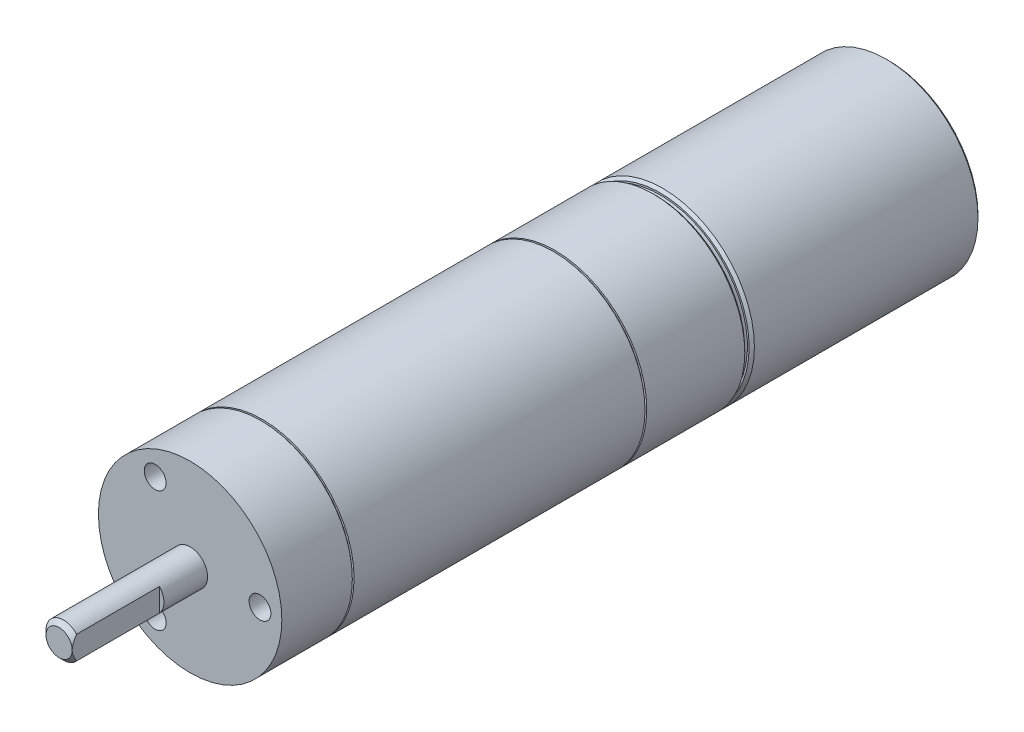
ISO-10303-21;
HEADER;
FILE_DESCRIPTION(('STEP AP214'),'2;1');
FILE_NAME('part.step','',(''),(''),'','','');
FILE_SCHEMA(('AUTOMOTIVE_DESIGN { 1 0 10303 214 1 1 1 1 }'));
ENDSEC;
DATA;
#1=APPLICATION_CONTEXT('core data for automotive mechanical design processes');
#2=APPLICATION_PROTOCOL_DEFINITION('international standard','automotive_design',2000,#1);
#3=PRODUCT_CONTEXT('',#1,'mechanical');
#4=PRODUCT('Part','Part','',(#3));
#5=PRODUCT_RELATED_PRODUCT_CATEGORY('part','',(#4));
#6=PRODUCT_DEFINITION_FORMATION('','',#4);
#7=PRODUCT_DEFINITION_CONTEXT('part definition',#1,'design');
#8=PRODUCT_DEFINITION('design','',#6,#7);
#9=PRODUCT_DEFINITION_SHAPE('','',#8);
#10=(LENGTH_UNIT() NAMED_UNIT(*) SI_UNIT(.MILLI.,.METRE.));
#11=(NAMED_UNIT(*) PLANE_ANGLE_UNIT() SI_UNIT($,.RADIAN.));
#12=(NAMED_UNIT(*) SI_UNIT($,.STERADIAN.) SOLID_ANGLE_UNIT());
#13=UNCERTAINTY_MEASURE_WITH_UNIT(LENGTH_MEASURE(1.E-05),#10,'distance_accuracy_value','');
#14=(GEOMETRIC_REPRESENTATION_CONTEXT(3) GLOBAL_UNCERTAINTY_ASSIGNED_CONTEXT((#13)) GLOBAL_UNIT_ASSIGNED_CONTEXT((#10,
#11,#12)) REPRESENTATION_CONTEXT('',''));
#15=CARTESIAN_POINT('',(0.,0.,0.));
#16=DIRECTION('',(0.,0.,1.));
#17=DIRECTION('',(1.,0.,0.));
#18=AXIS2_PLACEMENT_3D('',#15,#16,#17);
#19=CARTESIAN_POINT('',(0.,0.,80.));
#20=DIRECTION('',(0.,0.,-1.));
#21=DIRECTION('',(-1.,0.,0.));
#22=AXIS2_PLACEMENT_3D('',#19,#20,#21);
#23=CYLINDRICAL_SURFACE('',#22,10.5);
#24=CARTESIAN_POINT('',(0.,0.,26.9977784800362));
#25=DIRECTION('',(0.,0.,-1.));
#26=DIRECTION('',(-1.,0.,0.));
#27=AXIS2_PLACEMENT_3D('',#24,#25,#26);
#28=CIRCLE('',#27,10.5);
#29=CARTESIAN_POINT('',(-10.5,0.,26.9977784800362));
#30=VERTEX_POINT('',#29);
#31=EDGE_CURVE('E155',#30,#30,#28,.F.);
#32=ORIENTED_EDGE('',*,*,#31,.T.);
#33=EDGE_LOOP('',(#32));
#34=FACE_BOUND('',#33,.T.);
#35=CARTESIAN_POINT('',(0.,0.,38.2215074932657));
#36=DIRECTION('',(0.,0.,1.));
#37=DIRECTION('',(1.,0.,0.));
#38=AXIS2_PLACEMENT_3D('',#35,#36,#37);
#39=CIRCLE('',#38,10.5);
#40=CARTESIAN_POINT('',(10.5,0.,38.2215074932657));
#41=VERTEX_POINT('',#40);
#42=EDGE_CURVE('E99',#41,#41,#39,.T.);
#43=ORIENTED_EDGE('',*,*,#42,.F.);
#44=EDGE_LOOP('',(#43));
#45=FACE_BOUND('',#44,.T.);
#46=ADVANCED_FACE('F38',(#34,#45),#23,.T.);
#47=CARTESIAN_POINT('',(0.,0.,71.7283946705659));
#48=DIRECTION('',(0.,0.,1.));
#49=DIRECTION('',(1.,0.,0.));
#50=AXIS2_PLACEMENT_3D('',#47,#48,#49);
#51=CIRCLE('',#50,10.5);
#52=CARTESIAN_POINT('',(10.5,0.,71.7283946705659));
#53=VERTEX_POINT('',#52);
#54=EDGE_CURVE('E102',#53,#53,#51,.T.);
#55=ORIENTED_EDGE('',*,*,#54,.F.);
#56=EDGE_LOOP('',(#55));
#57=FACE_BOUND('',#56,.T.);
#58=CARTESIAN_POINT('',(0.,0.,38.4215074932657));
#59=DIRECTION('',(0.,0.,-1.));
#60=DIRECTION('',(-1.,0.,0.));
#61=AXIS2_PLACEMENT_3D('',#58,#59,#60);
#62=CIRCLE('',#61,10.5);
#63=CARTESIAN_POINT('',(-10.5,0.,38.4215074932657));
#64=VERTEX_POINT('',#63);
#65=EDGE_CURVE('E94',#64,#64,#62,.T.);
#66=ORIENTED_EDGE('',*,*,#65,.F.);
#67=EDGE_LOOP('',(#66));
#68=FACE_BOUND('',#67,.T.);
#69=ADVANCED_FACE('F190',(#57,#68),#23,.T.);
#70=CARTESIAN_POINT('',(0.,0.,80.));
#71=DIRECTION('',(0.,0.,1.));
#72=DIRECTION('',(1.,0.,0.));
#73=AXIS2_PLACEMENT_3D('',#70,#71,#72);
#74=CIRCLE('',#73,10.5);
#75=CARTESIAN_POINT('',(10.5,0.,80.));
#76=VERTEX_POINT('',#75);
#77=EDGE_CURVE('E125',#76,#76,#74,.T.);
#78=ORIENTED_EDGE('',*,*,#77,.F.);
#79=EDGE_LOOP('',(#78));
#80=FACE_BOUND('',#79,.T.);
#81=CARTESIAN_POINT('',(0.,0.,71.9283946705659));
#82=DIRECTION('',(0.,0.,-1.));
#83=DIRECTION('',(-1.,0.,0.));
#84=AXIS2_PLACEMENT_3D('',#81,#82,#83);
#85=CIRCLE('',#84,10.5);
#86=CARTESIAN_POINT('',(-10.5,0.,71.9283946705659));
#87=VERTEX_POINT('',#86);
#88=EDGE_CURVE('E110',#87,#87,#85,.T.);
#89=ORIENTED_EDGE('',*,*,#88,.F.);
#90=EDGE_LOOP('',(#89));
#91=FACE_BOUND('',#90,.T.);
#92=ADVANCED_FACE('F174',(#80,#91),#23,.T.);
#93=CARTESIAN_POINT('',(0.,0.,80.));
#94=DIRECTION('',(0.,0.,1.));
#95=DIRECTION('',(1.,0.,0.));
#96=AXIS2_PLACEMENT_3D('',#93,#94,#95);
#97=PLANE('',#96);
#98=CARTESIAN_POINT('',(-4.00000000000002,-6.9282032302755,80.));
#99=DIRECTION('',(0.,0.,1.));
#100=DIRECTION('',(1.,0.,0.));
#101=AXIS2_PLACEMENT_3D('',#98,#99,#100);
#102=CIRCLE('',#101,1.25);
#103=CARTESIAN_POINT('',(-2.75000000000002,-6.9282032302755,80.));
#104=VERTEX_POINT('',#103);
#105=EDGE_CURVE('E107',#104,#104,#102,.T.);
#106=ORIENTED_EDGE('',*,*,#105,.F.);
#107=EDGE_LOOP('',(#106));
#108=FACE_BOUND('',#107,.T.);
#109=CARTESIAN_POINT('',(8.,0.,80.));
#110=DIRECTION('',(0.,0.,1.));
#111=DIRECTION('',(1.,0.,0.));
#112=AXIS2_PLACEMENT_3D('',#109,#110,#111);
#113=CIRCLE('',#112,1.25);
#114=CARTESIAN_POINT('',(9.25,0.,80.));
#115=VERTEX_POINT('',#114);
#116=EDGE_CURVE('E106',#115,#115,#113,.T.);
#117=ORIENTED_EDGE('',*,*,#116,.F.);
#118=EDGE_LOOP('',(#117));
#119=FACE_BOUND('',#118,.T.);
#120=CARTESIAN_POINT('',(-3.99999999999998,6.92820323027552,80.));
#121=DIRECTION('',(0.,0.,1.));
#122=DIRECTION('',(1.,0.,0.));
#123=AXIS2_PLACEMENT_3D('',#120,#121,#122);
#124=CIRCLE('',#123,1.25);
#125=CARTESIAN_POINT('',(-2.74999999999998,6.92820323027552,80.));
#126=VERTEX_POINT('',#125);
#127=EDGE_CURVE('E114',#126,#126,#124,.T.);
#128=ORIENTED_EDGE('',*,*,#127,.F.);
#129=EDGE_LOOP('',(#128));
#130=FACE_BOUND('',#129,.T.);
#131=ORIENTED_EDGE('',*,*,#77,.T.);
#132=EDGE_LOOP('',(#131));
#133=FACE_BOUND('',#132,.T.);
#134=CARTESIAN_POINT('',(0.,0.,80.));
#135=DIRECTION('',(0.,0.,1.));
#136=DIRECTION('',(1.,0.,0.));
#137=AXIS2_PLACEMENT_3D('',#134,#135,#136);
#138=CIRCLE('',#137,2.);
#139=CARTESIAN_POINT('',(2.,0.,80.));
#140=VERTEX_POINT('',#139);
#141=EDGE_CURVE('E120',#140,#140,#138,.T.);
#142=ORIENTED_EDGE('',*,*,#141,.F.);
#143=EDGE_LOOP('',(#142));
#144=FACE_BOUND('',#143,.T.);
#145=ADVANCED_FACE('F201',(#108,#119,#130,#133,#144),#97,.T.);
#146=CARTESIAN_POINT('',(0.,0.,95.));
#147=DIRECTION('',(0.,0.,-1.));
#148=DIRECTION('',(-1.,0.,0.));
#149=AXIS2_PLACEMENT_3D('',#146,#147,#148);
#150=CYLINDRICAL_SURFACE('',#149,2.);
#151=CARTESIAN_POINT('',(0.,0.,94.5));
#152=DIRECTION('',(0.,0.,1.));
#153=DIRECTION('',(1.,0.,0.));
#154=AXIS2_PLACEMENT_3D('',#151,#152,#153);
#155=CIRCLE('',#154,2.);
#156=CARTESIAN_POINT('',(1.5,-1.32287565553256,94.5));
#157=VERTEX_POINT('',#156);
#158=CARTESIAN_POINT('',(1.5,1.3228756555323,94.5));
#159=VERTEX_POINT('',#158);
#160=EDGE_CURVE('E78',#157,#159,#155,.F.);
#161=ORIENTED_EDGE('',*,*,#160,.T.);
#162=DIRECTION('',(0.,0.,-1.));
#163=VECTOR('',#162,1.);
#164=CARTESIAN_POINT('',(1.5,1.3228756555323,95.));
#165=LINE('',#164,#163);
#166=CARTESIAN_POINT('',(1.5,1.3228756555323,85.));
#167=VERTEX_POINT('',#166);
#168=EDGE_CURVE('E57',#159,#167,#165,.T.);
#169=ORIENTED_EDGE('',*,*,#168,.T.);
#170=CARTESIAN_POINT('',(0.,0.,85.));
#171=DIRECTION('',(0.,0.,1.));
#172=DIRECTION('',(1.,0.,0.));
#173=AXIS2_PLACEMENT_3D('',#170,#171,#172);
#174=CIRCLE('',#173,2.);
#175=CARTESIAN_POINT('',(1.5,-1.32287565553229,85.));
#176=VERTEX_POINT('',#175);
#177=EDGE_CURVE('E11',#176,#167,#174,.T.);
#178=ORIENTED_EDGE('',*,*,#177,.F.);
#179=DIRECTION('',(0.,0.,-1.));
#180=VECTOR('',#179,1.);
#181=CARTESIAN_POINT('',(1.5,-1.32287565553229,95.));
#182=LINE('',#181,#180);
#183=EDGE_CURVE('E72',#176,#157,#182,.F.);
#184=ORIENTED_EDGE('',*,*,#183,.T.);
#185=EDGE_LOOP('',(#161,#169,#178,#184));
#186=FACE_BOUND('',#185,.T.);
#187=ORIENTED_EDGE('',*,*,#141,.T.);
#188=EDGE_LOOP('',(#187));
#189=FACE_BOUND('',#188,.T.);
#190=ADVANCED_FACE('F75',(#186,#189),#150,.T.);
#191=CARTESIAN_POINT('',(0.,0.,95.));
#192=DIRECTION('',(0.,0.,1.));
#193=DIRECTION('',(1.,0.,0.));
#194=AXIS2_PLACEMENT_3D('',#191,#192,#193);
#195=PLANE('',#194);
#196=CARTESIAN_POINT('',(0.,0.,95.));
#197=DIRECTION('',(0.,0.,1.));
#198=DIRECTION('',(1.,0.,0.));
#199=AXIS2_PLACEMENT_3D('',#196,#197,#198);
#200=CIRCLE('',#199,1.50000000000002);
#201=CARTESIAN_POINT('',(1.50000000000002,0.,95.));
#202=VERTEX_POINT('',#201);
#203=EDGE_CURVE('E128',#202,#202,#200,.T.);
#204=ORIENTED_EDGE('',*,*,#203,.T.);
#205=EDGE_LOOP('',(#204));
#206=FACE_BOUND('',#205,.T.);
#207=ADVANCED_FACE('F172',(#206),#195,.T.);
#208=CARTESIAN_POINT('',(0.,0.,95.));
#209=DIRECTION('',(0.,0.,-1.));
#210=DIRECTION('',(-1.,0.,0.));
#211=AXIS2_PLACEMENT_3D('',#208,#209,#210);
#212=CONICAL_SURFACE('',#211,1.50000000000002,0.785398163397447);
#213=CARTESIAN_POINT('',(1.5,-2.91383447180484,93.2227402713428));
#214=CARTESIAN_POINT('',(1.5,-2.84632281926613,93.282755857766));
#215=CARTESIAN_POINT('',(1.5,-2.77860211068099,93.3425385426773));
#216=CARTESIAN_POINT('',(1.5,-2.64263139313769,93.4615133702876));
#217=CARTESIAN_POINT('',(1.5,-2.57438132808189,93.5207054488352));
#218=CARTESIAN_POINT('',(1.5,-2.43695412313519,93.6386196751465));
#219=CARTESIAN_POINT('',(1.5,-2.36777422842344,93.6973386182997));
#220=CARTESIAN_POINT('',(1.5,-2.22864291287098,93.8138499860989));
#221=CARTESIAN_POINT('',(1.5,-2.15869152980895,93.871642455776));
#222=CARTESIAN_POINT('',(1.5,-2.01369677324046,93.9894064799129));
#223=CARTESIAN_POINT('',(1.5,-1.93859546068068,94.0493069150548));
#224=CARTESIAN_POINT('',(1.5,-1.78703130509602,94.1673579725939));
#225=CARTESIAN_POINT('',(1.5,-1.71056855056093,94.2255087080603));
#226=CARTESIAN_POINT('',(1.5,-1.5560213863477,94.339335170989));
#227=CARTESIAN_POINT('',(1.5,-1.477940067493,94.3950150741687));
#228=CARTESIAN_POINT('',(1.5,-1.31952631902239,94.5030563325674));
#229=CARTESIAN_POINT('',(1.5,-1.23919471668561,94.5554188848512));
#230=CARTESIAN_POINT('',(1.5,-1.10052560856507,94.6401240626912));
#231=CARTESIAN_POINT('',(1.5,-1.04294766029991,94.673703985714));
#232=CARTESIAN_POINT('',(1.5,-0.926084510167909,94.7378300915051));
#233=CARTESIAN_POINT('',(1.5,-0.86679878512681,94.7683753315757));
#234=CARTESIAN_POINT('',(1.5,-0.746799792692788,94.8252042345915));
#235=CARTESIAN_POINT('',(1.5,-0.686102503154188,94.851521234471));
#236=CARTESIAN_POINT('',(1.5,-0.562697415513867,94.8989401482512));
#237=CARTESIAN_POINT('',(1.5,-0.499990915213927,94.9200453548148));
#238=CARTESIAN_POINT('',(1.5,-0.392743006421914,94.9500019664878));
#239=CARTESIAN_POINT('',(1.5,-0.348695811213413,94.960619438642));
#240=CARTESIAN_POINT('',(1.5,-0.259894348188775,94.9782725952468));
#241=CARTESIAN_POINT('',(1.5,-0.21514035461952,94.9853096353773));
#242=CARTESIAN_POINT('',(1.5,-0.125302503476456,94.9954352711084));
#243=CARTESIAN_POINT('',(1.5,-0.0802198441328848,94.9985343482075));
#244=CARTESIAN_POINT('',(1.5,0.0100433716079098,95.0006449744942));
#245=CARTESIAN_POINT('',(1.5,0.0552239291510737,94.9996564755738));
#246=CARTESIAN_POINT('',(1.5,0.14522645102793,94.9936542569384));
#247=CARTESIAN_POINT('',(1.5,0.190048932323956,94.9886481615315));
#248=CARTESIAN_POINT('',(1.5,0.279116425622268,94.9748874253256));
#249=CARTESIAN_POINT('',(1.5,0.323361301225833,94.9661319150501));
#250=CARTESIAN_POINT('',(1.5,0.411210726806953,94.9452444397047));
#251=CARTESIAN_POINT('',(1.5,0.454812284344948,94.9331000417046));
#252=CARTESIAN_POINT('',(1.5,0.541090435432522,94.9059155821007));
#253=CARTESIAN_POINT('',(1.5,0.583767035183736,94.8908755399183));
#254=CARTESIAN_POINT('',(1.5,0.736564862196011,94.8320457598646));
#255=CARTESIAN_POINT('',(1.5,0.843947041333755,94.7811522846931));
#256=CARTESIAN_POINT('',(1.5,1.05333291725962,94.6692461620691));
#257=CARTESIAN_POINT('',(1.5,1.1553229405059,94.6082092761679));
#258=CARTESIAN_POINT('',(1.5,1.35668988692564,94.4789646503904));
#259=CARTESIAN_POINT('',(1.5,1.45600815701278,94.4106664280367));
#260=CARTESIAN_POINT('',(1.5,1.60265082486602,94.3051525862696));
#261=CARTESIAN_POINT('',(1.5,1.65111611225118,94.2694910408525));
#262=CARTESIAN_POINT('',(1.5,1.74740058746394,94.1973074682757));
#263=CARTESIAN_POINT('',(1.5,1.79521979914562,94.1607854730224));
#264=CARTESIAN_POINT('',(1.5,1.95618427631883,94.035958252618));
#265=CARTESIAN_POINT('',(1.5,2.06805306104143,93.9460090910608));
#266=CARTESIAN_POINT('',(1.5,2.28963458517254,93.7634860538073));
#267=CARTESIAN_POINT('',(1.5,2.3993470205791,93.6709118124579));
#268=CARTESIAN_POINT('',(1.5,2.61724618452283,93.4839015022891));
#269=CARTESIAN_POINT('',(1.5,2.72543228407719,93.3894647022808));
#270=CARTESIAN_POINT('',(1.5,2.94063718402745,93.1992684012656));
#271=CARTESIAN_POINT('',(1.5,3.04765595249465,93.103508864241));
#272=CARTESIAN_POINT('',(1.5,3.36781602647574,92.8143950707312));
#273=CARTESIAN_POINT('',(1.5,3.57963413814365,92.6195772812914));
#274=CARTESIAN_POINT('',(1.5,4.00106848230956,92.2276899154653));
#275=CARTESIAN_POINT('',(1.5,4.21068523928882,92.0306208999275));
#276=CARTESIAN_POINT('',(1.5,4.60383939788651,91.6583223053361));
#277=CARTESIAN_POINT('',(1.5,4.78753524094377,91.4832598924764));
#278=CARTESIAN_POINT('',(1.5,5.15413935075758,91.1322856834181));
#279=CARTESIAN_POINT('',(1.5,5.33704755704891,90.9563738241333));
#280=CARTESIAN_POINT('',(1.5,5.70165470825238,90.6045288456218));
#281=CARTESIAN_POINT('',(1.5,5.88335565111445,90.4285977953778));
#282=CARTESIAN_POINT('',(1.5,6.24628302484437,90.0762777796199));
#283=CARTESIAN_POINT('',(1.5,6.42750949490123,89.8998888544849));
#284=CARTESIAN_POINT('',(1.5,6.6085719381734,89.7233324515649));
#285=B_SPLINE_CURVE_WITH_KNOTS('',3,(#213,#214,#215,#216,#217,#218,#219,#220,#221,#222,#223,
#224,#225,#226,#227,#228,#229,#230,#231,#232,#233,#234,#235,#236,#237,#238,#239,#240,#241,#242,
#243,#244,#245,#246,#247,#248,#249,#250,#251,#252,#253,#254,#255,#256,#257,#258,#259,#260,#261,
#262,#263,#264,#265,#266,#267,#268,#269,#270,#271,#272,#273,#274,#275,#276,#277,#278,#279,#280,
#281,#282,#283,#284),.UNSPECIFIED.,.F.,.F.,(4,2,2,2,2,2,2,2,2,2,2,2,2,2,2,2,2,2,2,2,2,2,2,2,2,2,
2,2,2,2,2,2,2,2,2,4),(0.,0.270994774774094,0.542018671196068,0.81423259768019,1.08643325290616,
1.37460597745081,1.66276003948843,1.95040697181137,2.2379495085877,2.43784579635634,
2.6378039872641,2.8360987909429,3.03426799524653,3.17006813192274,3.30581681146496,
3.44120341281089,3.57659160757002,3.71172347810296,3.84688670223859,3.98255247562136,
4.11821733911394,4.47365712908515,4.82995881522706,5.1913832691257,5.37189350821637,
5.55239706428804,5.98296540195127,6.41359401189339,6.84439517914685,7.27520810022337,
8.13853180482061,9.00164492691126,9.76290262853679,10.5242177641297,11.2829675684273,
12.0416525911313),.UNSPECIFIED.);
#286=EDGE_CURVE('E46',#159,#202,#285,.F.);
#287=ORIENTED_EDGE('',*,*,#286,.F.);
#288=ORIENTED_EDGE('',*,*,#160,.F.);
#289=EDGE_CURVE('E157',#202,#157,#285,.F.);
#290=ORIENTED_EDGE('',*,*,#289,.F.);
#291=ORIENTED_EDGE('',*,*,#203,.F.);
#292=EDGE_LOOP('',(#287,#288,#290,#291));
#293=FACE_BOUND('',#292,.T.);
#294=ADVANCED_FACE('F166',(#293),#212,.T.);
#295=CARTESIAN_POINT('',(-3.99999999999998,6.92820323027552,75.));
#296=DIRECTION('',(0.,0.,1.));
#297=DIRECTION('',(1.,0.,0.));
#298=AXIS2_PLACEMENT_3D('',#295,#296,#297);
#299=CYLINDRICAL_SURFACE('',#298,1.25);
#300=CARTESIAN_POINT('',(-3.99999999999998,6.92820323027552,75.));
#301=DIRECTION('',(0.,0.,1.));
#302=DIRECTION('',(1.,0.,0.));
#303=AXIS2_PLACEMENT_3D('',#300,#301,#302);
#304=CIRCLE('',#303,1.25);
#305=CARTESIAN_POINT('',(-2.74999999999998,6.92820323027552,75.));
#306=VERTEX_POINT('',#305);
#307=EDGE_CURVE('E117',#306,#306,#304,.T.);
#308=ORIENTED_EDGE('',*,*,#307,.F.);
#309=EDGE_LOOP('',(#308));
#310=FACE_BOUND('',#309,.T.);
#311=ORIENTED_EDGE('',*,*,#127,.T.);
#312=EDGE_LOOP('',(#311));
#313=FACE_BOUND('',#312,.T.);
#314=ADVANCED_FACE('F171',(#310,#313),#299,.F.);
#315=CARTESIAN_POINT('',(-3.99999999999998,6.92820323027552,75.));
#316=DIRECTION('',(0.,0.,1.));
#317=DIRECTION('',(1.,0.,0.));
#318=AXIS2_PLACEMENT_3D('',#315,#316,#317);
#319=PLANE('',#318);
#320=ORIENTED_EDGE('',*,*,#307,.T.);
#321=EDGE_LOOP('',(#320));
#322=FACE_BOUND('',#321,.T.);
#323=ADVANCED_FACE('F241',(#322),#319,.T.);
#324=CARTESIAN_POINT('',(8.,0.,75.));
#325=DIRECTION('',(0.,0.,1.));
#326=DIRECTION('',(1.,0.,0.));
#327=AXIS2_PLACEMENT_3D('',#324,#325,#326);
#328=CYLINDRICAL_SURFACE('',#327,1.25);
#329=CARTESIAN_POINT('',(8.,0.,75.));
#330=DIRECTION('',(0.,0.,1.));
#331=DIRECTION('',(1.,0.,0.));
#332=AXIS2_PLACEMENT_3D('',#329,#330,#331);
#333=CIRCLE('',#332,1.25);
#334=CARTESIAN_POINT('',(9.25,0.,75.));
#335=VERTEX_POINT('',#334);
#336=EDGE_CURVE('E111',#335,#335,#333,.T.);
#337=ORIENTED_EDGE('',*,*,#336,.F.);
#338=EDGE_LOOP('',(#337));
#339=FACE_BOUND('',#338,.T.);
#340=ORIENTED_EDGE('',*,*,#116,.T.);
#341=EDGE_LOOP('',(#340));
#342=FACE_BOUND('',#341,.T.);
#343=ADVANCED_FACE('F237',(#339,#342),#328,.F.);
#344=CARTESIAN_POINT('',(8.,0.,75.));
#345=DIRECTION('',(0.,0.,1.));
#346=DIRECTION('',(1.,0.,0.));
#347=AXIS2_PLACEMENT_3D('',#344,#345,#346);
#348=PLANE('',#347);
#349=ORIENTED_EDGE('',*,*,#336,.T.);
#350=EDGE_LOOP('',(#349));
#351=FACE_BOUND('',#350,.T.);
#352=ADVANCED_FACE('F233',(#351),#348,.T.);
#353=CARTESIAN_POINT('',(-4.00000000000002,-6.9282032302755,75.));
#354=DIRECTION('',(0.,0.,1.));
#355=DIRECTION('',(1.,0.,0.));
#356=AXIS2_PLACEMENT_3D('',#353,#354,#355);
#357=CYLINDRICAL_SURFACE('',#356,1.25);
#358=CARTESIAN_POINT('',(-4.00000000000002,-6.9282032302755,75.));
#359=DIRECTION('',(0.,0.,1.));
#360=DIRECTION('',(1.,0.,0.));
#361=AXIS2_PLACEMENT_3D('',#358,#359,#360);
#362=CIRCLE('',#361,1.25);
#363=CARTESIAN_POINT('',(-2.75000000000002,-6.9282032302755,75.));
#364=VERTEX_POINT('',#363);
#365=EDGE_CURVE('E103',#364,#364,#362,.T.);
#366=ORIENTED_EDGE('',*,*,#365,.F.);
#367=EDGE_LOOP('',(#366));
#368=FACE_BOUND('',#367,.T.);
#369=ORIENTED_EDGE('',*,*,#105,.T.);
#370=EDGE_LOOP('',(#369));
#371=FACE_BOUND('',#370,.T.);
#372=ADVANCED_FACE('F225',(#368,#371),#357,.F.);
#373=CARTESIAN_POINT('',(-4.00000000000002,-6.9282032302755,75.));
#374=DIRECTION('',(0.,0.,1.));
#375=DIRECTION('',(1.,0.,0.));
#376=AXIS2_PLACEMENT_3D('',#373,#374,#375);
#377=PLANE('',#376);
#378=ORIENTED_EDGE('',*,*,#365,.T.);
#379=EDGE_LOOP('',(#378));
#380=FACE_BOUND('',#379,.T.);
#381=ADVANCED_FACE('F215',(#380),#377,.T.);
#382=CARTESIAN_POINT('',(-11.5069297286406,0.,71.9283946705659));
#383=DIRECTION('',(0.,0.,-1.));
#384=DIRECTION('',(-1.,0.,0.));
#385=AXIS2_PLACEMENT_3D('',#382,#383,#384);
#386=PLANE('',#385);
#387=CARTESIAN_POINT('',(0.,0.,71.9283946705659));
#388=DIRECTION('',(0.,0.,-1.));
#389=DIRECTION('',(-1.,0.,0.));
#390=AXIS2_PLACEMENT_3D('',#387,#388,#389);
#391=CIRCLE('',#390,10.2762378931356);
#392=CARTESIAN_POINT('',(-10.2762378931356,0.,71.9283946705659));
#393=VERTEX_POINT('',#392);
#394=EDGE_CURVE('E98',#393,#393,#391,.T.);
#395=ORIENTED_EDGE('',*,*,#394,.F.);
#396=EDGE_LOOP('',(#395));
#397=FACE_BOUND('',#396,.T.);
#398=ORIENTED_EDGE('',*,*,#88,.T.);
#399=EDGE_LOOP('',(#398));
#400=FACE_BOUND('',#399,.T.);
#401=ADVANCED_FACE('F212',(#397,#400),#386,.T.);
#402=CARTESIAN_POINT('',(-11.5069297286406,0.,71.7283946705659));
#403=DIRECTION('',(0.,0.,1.));
#404=DIRECTION('',(1.,0.,0.));
#405=AXIS2_PLACEMENT_3D('',#402,#403,#404);
#406=PLANE('',#405);
#407=CARTESIAN_POINT('',(0.,0.,71.7283946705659));
#408=DIRECTION('',(0.,0.,-1.));
#409=DIRECTION('',(-1.,0.,0.));
#410=AXIS2_PLACEMENT_3D('',#407,#408,#409);
#411=CIRCLE('',#410,10.2762378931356);
#412=CARTESIAN_POINT('',(-10.2762378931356,0.,71.7283946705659));
#413=VERTEX_POINT('',#412);
#414=EDGE_CURVE('E95',#413,#413,#411,.T.);
#415=ORIENTED_EDGE('',*,*,#414,.T.);
#416=EDGE_LOOP('',(#415));
#417=FACE_BOUND('',#416,.T.);
#418=ORIENTED_EDGE('',*,*,#54,.T.);
#419=EDGE_LOOP('',(#418));
#420=FACE_BOUND('',#419,.T.);
#421=ADVANCED_FACE('F214',(#417,#420),#406,.T.);
#422=CARTESIAN_POINT('',(0.,0.,-6.64114582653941));
#423=DIRECTION('',(0.,0.,-1.));
#424=DIRECTION('',(-1.,0.,0.));
#425=AXIS2_PLACEMENT_3D('',#422,#423,#424);
#426=CYLINDRICAL_SURFACE('',#425,10.2762378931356);
#427=ORIENTED_EDGE('',*,*,#394,.T.);
#428=EDGE_LOOP('',(#427));
#429=FACE_BOUND('',#428,.T.);
#430=ORIENTED_EDGE('',*,*,#414,.F.);
#431=EDGE_LOOP('',(#430));
#432=FACE_BOUND('',#431,.T.);
#433=ADVANCED_FACE('F222',(#429,#432),#426,.T.);
#434=CARTESIAN_POINT('',(-10.2762378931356,0.,38.2215074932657));
#435=DIRECTION('',(0.,0.,1.));
#436=DIRECTION('',(1.,0.,0.));
#437=AXIS2_PLACEMENT_3D('',#434,#435,#436);
#438=PLANE('',#437);
#439=CARTESIAN_POINT('',(0.,0.,38.2215074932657));
#440=DIRECTION('',(0.,0.,-1.));
#441=DIRECTION('',(-1.,0.,0.));
#442=AXIS2_PLACEMENT_3D('',#439,#440,#441);
#443=CIRCLE('',#442,10.2762378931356);
#444=CARTESIAN_POINT('',(-10.2762378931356,0.,38.2215074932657));
#445=VERTEX_POINT('',#444);
#446=EDGE_CURVE('E91',#445,#445,#443,.T.);
#447=ORIENTED_EDGE('',*,*,#446,.T.);
#448=EDGE_LOOP('',(#447));
#449=FACE_BOUND('',#448,.T.);
#450=ORIENTED_EDGE('',*,*,#42,.T.);
#451=EDGE_LOOP('',(#450));
#452=FACE_BOUND('',#451,.T.);
#453=ADVANCED_FACE('F274',(#449,#452),#438,.T.);
#454=CARTESIAN_POINT('',(-10.2762378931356,0.,38.4215074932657));
#455=DIRECTION('',(0.,0.,-1.));
#456=DIRECTION('',(-1.,0.,0.));
#457=AXIS2_PLACEMENT_3D('',#454,#455,#456);
#458=PLANE('',#457);
#459=CARTESIAN_POINT('',(0.,0.,38.4215074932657));
#460=DIRECTION('',(0.,0.,-1.));
#461=DIRECTION('',(-1.,0.,0.));
#462=AXIS2_PLACEMENT_3D('',#459,#460,#461);
#463=CIRCLE('',#462,10.2762378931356);
#464=CARTESIAN_POINT('',(-10.2762378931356,0.,38.4215074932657));
#465=VERTEX_POINT('',#464);
#466=EDGE_CURVE('E88',#465,#465,#463,.T.);
#467=ORIENTED_EDGE('',*,*,#466,.F.);
#468=EDGE_LOOP('',(#467));
#469=FACE_BOUND('',#468,.T.);
#470=ORIENTED_EDGE('',*,*,#65,.T.);
#471=EDGE_LOOP('',(#470));
#472=FACE_BOUND('',#471,.T.);
#473=ADVANCED_FACE('F270',(#469,#472),#458,.T.);
#474=CARTESIAN_POINT('',(0.,0.,-6.64114582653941));
#475=DIRECTION('',(0.,0.,-1.));
#476=DIRECTION('',(-1.,0.,0.));
#477=AXIS2_PLACEMENT_3D('',#474,#475,#476);
#478=CYLINDRICAL_SURFACE('',#477,10.2762378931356);
#479=ORIENTED_EDGE('',*,*,#466,.T.);
#480=EDGE_LOOP('',(#479));
#481=FACE_BOUND('',#480,.T.);
#482=ORIENTED_EDGE('',*,*,#446,.F.);
#483=EDGE_LOOP('',(#482));
#484=FACE_BOUND('',#483,.T.);
#485=ADVANCED_FACE('F273',(#481,#484),#478,.T.);
#486=CARTESIAN_POINT('',(-10.,0.,26.6977784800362));
#487=DIRECTION('',(0.,0.,-1.));
#488=DIRECTION('',(-1.,0.,0.));
#489=AXIS2_PLACEMENT_3D('',#486,#487,#488);
#490=PLANE('',#489);
#491=CARTESIAN_POINT('',(0.,0.,26.6977784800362));
#492=DIRECTION('',(0.,0.,-1.));
#493=DIRECTION('',(-1.,0.,0.));
#494=AXIS2_PLACEMENT_3D('',#491,#492,#493);
#495=CIRCLE('',#494,10.2);
#496=CARTESIAN_POINT('',(-10.2,0.,26.6977784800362));
#497=VERTEX_POINT('',#496);
#498=EDGE_CURVE('E152',#497,#497,#495,.T.);
#499=ORIENTED_EDGE('',*,*,#498,.T.);
#500=EDGE_LOOP('',(#499));
#501=FACE_BOUND('',#500,.T.);
#502=CARTESIAN_POINT('',(0.,0.,26.6977784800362));
#503=DIRECTION('',(0.,0.,-1.));
#504=DIRECTION('',(-1.,0.,0.));
#505=AXIS2_PLACEMENT_3D('',#502,#503,#504);
#506=CIRCLE('',#505,10.);
#507=CARTESIAN_POINT('',(-10.,0.,26.6977784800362));
#508=VERTEX_POINT('',#507);
#509=EDGE_CURVE('E82',#508,#508,#506,.T.);
#510=ORIENTED_EDGE('',*,*,#509,.F.);
#511=EDGE_LOOP('',(#510));
#512=FACE_BOUND('',#511,.T.);
#513=ADVANCED_FACE('F265',(#501,#512),#490,.T.);
#514=CARTESIAN_POINT('',(-10.,0.,26.1977784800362));
#515=DIRECTION('',(0.,0.,1.));
#516=DIRECTION('',(1.,0.,0.));
#517=AXIS2_PLACEMENT_3D('',#514,#515,#516);
#518=PLANE('',#517);
#519=CARTESIAN_POINT('',(0.,0.,26.1977784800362));
#520=DIRECTION('',(0.,0.,1.));
#521=DIRECTION('',(1.,0.,0.));
#522=AXIS2_PLACEMENT_3D('',#519,#520,#521);
#523=CIRCLE('',#522,10.2);
#524=CARTESIAN_POINT('',(10.2,0.,26.1977784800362));
#525=VERTEX_POINT('',#524);
#526=EDGE_CURVE('E132',#525,#525,#523,.T.);
#527=ORIENTED_EDGE('',*,*,#526,.T.);
#528=EDGE_LOOP('',(#527));
#529=FACE_BOUND('',#528,.T.);
#530=CARTESIAN_POINT('',(0.,0.,26.1977784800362));
#531=DIRECTION('',(0.,0.,-1.));
#532=DIRECTION('',(-1.,0.,0.));
#533=AXIS2_PLACEMENT_3D('',#530,#531,#532);
#534=CIRCLE('',#533,10.);
#535=CARTESIAN_POINT('',(-10.,0.,26.1977784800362));
#536=VERTEX_POINT('',#535);
#537=EDGE_CURVE('E79',#536,#536,#534,.T.);
#538=ORIENTED_EDGE('',*,*,#537,.T.);
#539=EDGE_LOOP('',(#538));
#540=FACE_BOUND('',#539,.T.);
#541=ADVANCED_FACE('F259',(#529,#540),#518,.T.);
#542=CARTESIAN_POINT('',(0.,0.,-6.64114582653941));
#543=DIRECTION('',(0.,0.,-1.));
#544=DIRECTION('',(-1.,0.,0.));
#545=AXIS2_PLACEMENT_3D('',#542,#543,#544);
#546=CYLINDRICAL_SURFACE('',#545,10.);
#547=ORIENTED_EDGE('',*,*,#509,.T.);
#548=EDGE_LOOP('',(#547));
#549=FACE_BOUND('',#548,.T.);
#550=ORIENTED_EDGE('',*,*,#537,.F.);
#551=EDGE_LOOP('',(#550));
#552=FACE_BOUND('',#551,.T.);
#553=ADVANCED_FACE('F254',(#549,#552),#546,.T.);
#554=CARTESIAN_POINT('',(0.,0.,0.));
#555=DIRECTION('',(0.,0.,1.));
#556=DIRECTION('',(1.,0.,0.));
#557=AXIS2_PLACEMENT_3D('',#554,#555,#556);
#558=PLANE('',#557);
#559=CARTESIAN_POINT('',(0.,0.,0.));
#560=DIRECTION('',(0.,0.,1.));
#561=DIRECTION('',(1.,0.,0.));
#562=AXIS2_PLACEMENT_3D('',#559,#560,#561);
#563=CIRCLE('',#562,10.2);
#564=CARTESIAN_POINT('',(10.2,0.,0.));
#565=VERTEX_POINT('',#564);
#566=EDGE_CURVE('E149',#565,#565,#563,.F.);
#567=ORIENTED_EDGE('',*,*,#566,.T.);
#568=EDGE_LOOP('',(#567));
#569=FACE_BOUND('',#568,.T.);
#570=ADVANCED_FACE('F198',(#569),#558,.F.);
#571=CARTESIAN_POINT('',(0.,0.,25.8977784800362));
#572=DIRECTION('',(0.,0.,1.));
#573=DIRECTION('',(1.,0.,0.));
#574=AXIS2_PLACEMENT_3D('',#571,#572,#573);
#575=CIRCLE('',#574,10.5);
#576=CARTESIAN_POINT('',(10.5,0.,25.8977784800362));
#577=VERTEX_POINT('',#576);
#578=EDGE_CURVE('E146',#577,#577,#575,.F.);
#579=ORIENTED_EDGE('',*,*,#578,.T.);
#580=EDGE_LOOP('',(#579));
#581=FACE_BOUND('',#580,.T.);
#582=CARTESIAN_POINT('',(0.,0.,0.299999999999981));
#583=DIRECTION('',(0.,0.,1.));
#584=DIRECTION('',(1.,0.,0.));
#585=AXIS2_PLACEMENT_3D('',#582,#583,#584);
#586=CIRCLE('',#585,10.5);
#587=CARTESIAN_POINT('',(10.5,0.,0.299999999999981));
#588=VERTEX_POINT('',#587);
#589=EDGE_CURVE('E143',#588,#588,#586,.T.);
#590=ORIENTED_EDGE('',*,*,#589,.T.);
#591=EDGE_LOOP('',(#590));
#592=FACE_BOUND('',#591,.T.);
#593=ADVANCED_FACE('F179',(#581,#592),#23,.T.);
#594=CARTESIAN_POINT('',(0.,0.,26.1977784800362));
#595=DIRECTION('',(0.,0.,-1.));
#596=DIRECTION('',(-1.,0.,0.));
#597=AXIS2_PLACEMENT_3D('',#594,#595,#596);
#598=CONICAL_SURFACE('',#597,10.2,0.785398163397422);
#599=ORIENTED_EDGE('',*,*,#578,.F.);
#600=EDGE_LOOP('',(#599));
#601=FACE_BOUND('',#600,.T.);
#602=ORIENTED_EDGE('',*,*,#526,.F.);
#603=EDGE_LOOP('',(#602));
#604=FACE_BOUND('',#603,.T.);
#605=ADVANCED_FACE('F176',(#601,#604),#598,.T.);
#606=CARTESIAN_POINT('',(0.,0.,0.299999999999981));
#607=DIRECTION('',(0.,0.,1.));
#608=DIRECTION('',(1.,0.,0.));
#609=AXIS2_PLACEMENT_3D('',#606,#607,#608);
#610=CONICAL_SURFACE('',#609,10.5,0.785398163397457);
#611=ORIENTED_EDGE('',*,*,#566,.F.);
#612=EDGE_LOOP('',(#611));
#613=FACE_BOUND('',#612,.T.);
#614=ORIENTED_EDGE('',*,*,#589,.F.);
#615=EDGE_LOOP('',(#614));
#616=FACE_BOUND('',#615,.T.);
#617=ADVANCED_FACE('F178',(#613,#616),#610,.T.);
#618=CARTESIAN_POINT('',(0.,0.,26.6977784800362));
#619=DIRECTION('',(0.,0.,1.));
#620=DIRECTION('',(1.,0.,0.));
#621=AXIS2_PLACEMENT_3D('',#618,#619,#620);
#622=CONICAL_SURFACE('',#621,10.2,0.785398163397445);
#623=ORIENTED_EDGE('',*,*,#31,.F.);
#624=EDGE_LOOP('',(#623));
#625=FACE_BOUND('',#624,.T.);
#626=ORIENTED_EDGE('',*,*,#498,.F.);
#627=EDGE_LOOP('',(#626));
#628=FACE_BOUND('',#627,.T.);
#629=ADVANCED_FACE('F40',(#625,#628),#622,.T.);
#630=CARTESIAN_POINT('',(1.5,-2.31965969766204,85.));
#631=DIRECTION('',(0.,0.,1.));
#632=DIRECTION('',(1.,0.,0.));
#633=AXIS2_PLACEMENT_3D('',#630,#631,#632);
#634=PLANE('',#633);
#635=ORIENTED_EDGE('',*,*,#177,.T.);
#636=DIRECTION('',(0.,-1.,0.));
#637=VECTOR('',#636,1.);
#638=CARTESIAN_POINT('',(1.5,2.83513963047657,85.));
#639=LINE('',#638,#637);
#640=EDGE_CURVE('E68',#167,#176,#639,.T.);
#641=ORIENTED_EDGE('',*,*,#640,.T.);
#642=EDGE_LOOP('',(#635,#641));
#643=FACE_BOUND('',#642,.T.);
#644=ADVANCED_FACE('F67',(#643),#634,.T.);
#645=CARTESIAN_POINT('',(1.5,2.83513963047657,85.));
#646=DIRECTION('',(-1.,0.,0.));
#647=DIRECTION('',(0.,-1.,0.));
#648=AXIS2_PLACEMENT_3D('',#645,#646,#647);
#649=PLANE('',#648);
#650=ORIENTED_EDGE('',*,*,#286,.T.);
#651=ORIENTED_EDGE('',*,*,#289,.T.);
#652=ORIENTED_EDGE('',*,*,#183,.F.);
#653=ORIENTED_EDGE('',*,*,#640,.F.);
#654=ORIENTED_EDGE('',*,*,#168,.F.);
#655=EDGE_LOOP('',(#650,#651,#652,#653,#654));
#656=FACE_BOUND('',#655,.T.);
#657=ADVANCED_FACE('F71',(#656),#649,.F.);
#658=CLOSED_SHELL('',(#46,#69,#92,#145,#190,#207,#294,#314,#323,#343,#352,#372,#381,#401,#421,
#433,#453,#473,#485,#513,#541,#553,#570,#593,#605,#617,#629,#644,#657));
#659=MANIFOLD_SOLID_BREP('B2',#658);
#660=ADVANCED_BREP_SHAPE_REPRESENTATION('',(#18,#659),#14);
#661=SHAPE_DEFINITION_REPRESENTATION(#9,#660);
ENDSEC;
END-ISO-10303-21;
